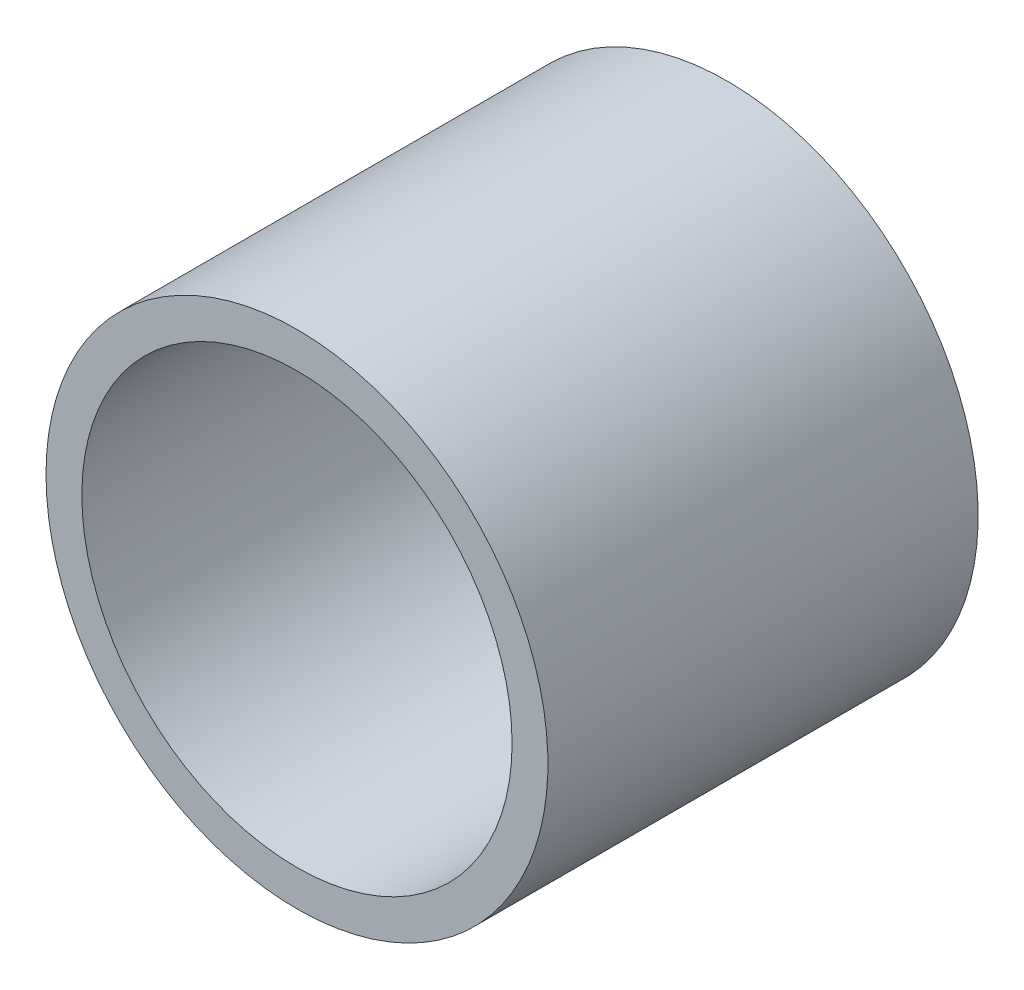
from build123d import *

# Parameters (mm, degrees)
ESQUISSE1_W = 1
ESQUISSE1_H = 12


with BuildPart() as part:
    # Esquisse1 → R_volution1 (revolve)
    with BuildSketch(Plane.XZ, mode=Mode.PRIVATE) as r_volution1_sk:
        with Locations((6.5, 6)):
            Rectangle(ESQUISSE1_W, ESQUISSE1_H)
    revolve(r_volution1_sk.sketch.rotate(Axis((0, 0, 17), (0, 0, -1)), 180), axis=Axis((0, 0, 17), (0, 0, -1)))


solid = part.part
